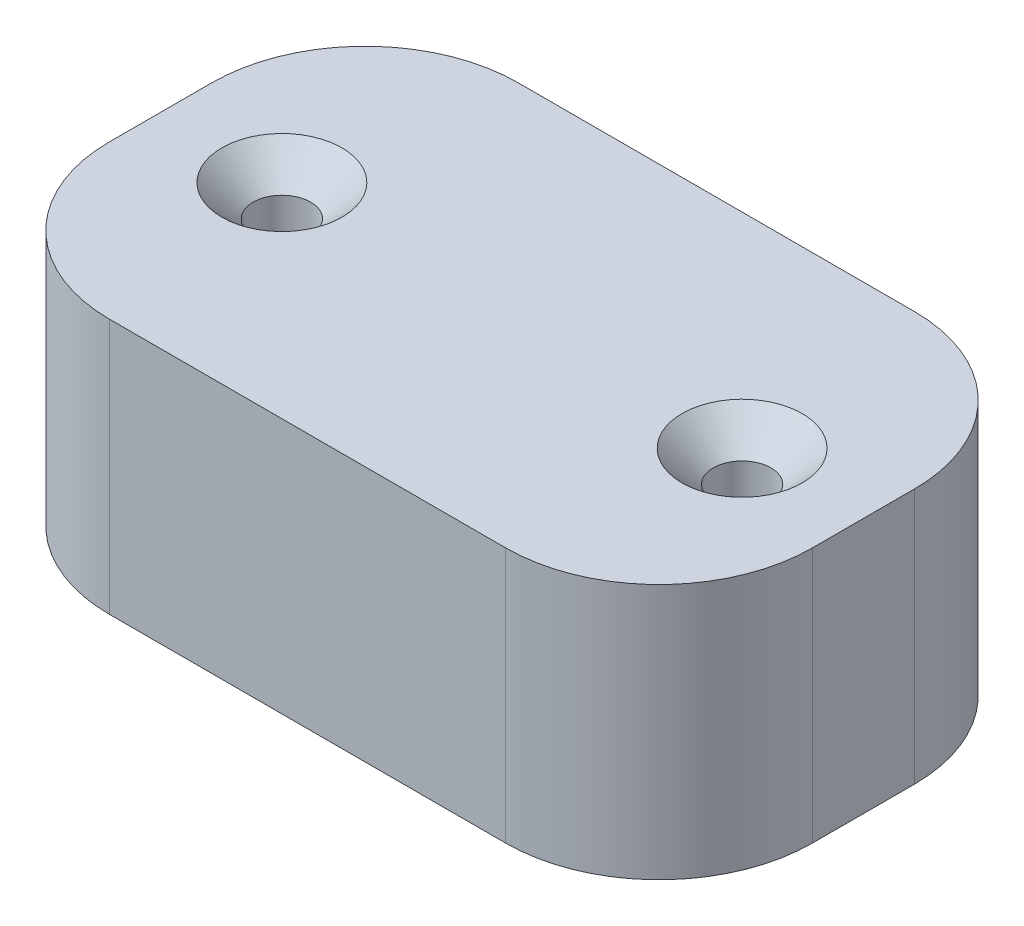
ISO-10303-21;
HEADER;
FILE_DESCRIPTION(('STEP AP214'),'2;1');
FILE_NAME('part.step','',(''),(''),'','','');
FILE_SCHEMA(('AUTOMOTIVE_DESIGN { 1 0 10303 214 1 1 1 1 }'));
ENDSEC;
DATA;
#1=APPLICATION_CONTEXT('core data for automotive mechanical design processes');
#2=APPLICATION_PROTOCOL_DEFINITION('international standard','automotive_design',2000,#1);
#3=PRODUCT_CONTEXT('',#1,'mechanical');
#4=PRODUCT('Part','Part','',(#3));
#5=PRODUCT_RELATED_PRODUCT_CATEGORY('part','',(#4));
#6=PRODUCT_DEFINITION_FORMATION('','',#4);
#7=PRODUCT_DEFINITION_CONTEXT('part definition',#1,'design');
#8=PRODUCT_DEFINITION('design','',#6,#7);
#9=PRODUCT_DEFINITION_SHAPE('','',#8);
#10=(LENGTH_UNIT() NAMED_UNIT(*) SI_UNIT(.MILLI.,.METRE.));
#11=(NAMED_UNIT(*) PLANE_ANGLE_UNIT() SI_UNIT($,.RADIAN.));
#12=(NAMED_UNIT(*) SI_UNIT($,.STERADIAN.) SOLID_ANGLE_UNIT());
#13=UNCERTAINTY_MEASURE_WITH_UNIT(LENGTH_MEASURE(1.E-05),#10,'distance_accuracy_value','');
#14=(GEOMETRIC_REPRESENTATION_CONTEXT(3) GLOBAL_UNCERTAINTY_ASSIGNED_CONTEXT((#13)) GLOBAL_UNIT_ASSIGNED_CONTEXT((#10,
#11,#12)) REPRESENTATION_CONTEXT('',''));
#15=CARTESIAN_POINT('',(0.,0.,0.));
#16=DIRECTION('',(0.,0.,1.));
#17=DIRECTION('',(1.,0.,0.));
#18=AXIS2_PLACEMENT_3D('',#15,#16,#17);
#19=CARTESIAN_POINT('',(-27.5,20.,16.));
#20=DIRECTION('',(0.,-1.,0.));
#21=DIRECTION('',(0.,0.,-1.));
#22=AXIS2_PLACEMENT_3D('',#19,#20,#21);
#23=PLANE('',#22);
#24=CARTESIAN_POINT('',(-18.,20.,0.));
#25=DIRECTION('',(0.,1.,0.));
#26=DIRECTION('',(0.,0.,1.));
#27=AXIS2_PLACEMENT_3D('',#24,#25,#26);
#28=CIRCLE('',#27,4.7);
#29=CARTESIAN_POINT('',(-18.,20.,4.7));
#30=VERTEX_POINT('',#29);
#31=EDGE_CURVE('E218',#30,#30,#28,.T.);
#32=ORIENTED_EDGE('',*,*,#31,.F.);
#33=EDGE_LOOP('',(#32));
#34=FACE_BOUND('',#33,.T.);
#35=DIRECTION('',(-1.,0.,0.));
#36=VECTOR('',#35,1.);
#37=CARTESIAN_POINT('',(-27.5,20.,16.));
#38=LINE('',#37,#36);
#39=CARTESIAN_POINT('',(15.5,20.,16.));
#40=VERTEX_POINT('',#39);
#41=CARTESIAN_POINT('',(-15.5,20.,16.));
#42=VERTEX_POINT('',#41);
#43=EDGE_CURVE('E113',#40,#42,#38,.T.);
#44=ORIENTED_EDGE('',*,*,#43,.F.);
#45=CARTESIAN_POINT('',(15.5,20.,4.));
#46=DIRECTION('',(0.,-1.,0.));
#47=DIRECTION('',(0.,0.,-1.));
#48=AXIS2_PLACEMENT_3D('',#45,#46,#47);
#49=CIRCLE('',#48,12.);
#50=CARTESIAN_POINT('',(27.5,20.,4.));
#51=VERTEX_POINT('',#50);
#52=EDGE_CURVE('E150',#40,#51,#49,.F.);
#53=ORIENTED_EDGE('',*,*,#52,.T.);
#54=DIRECTION('',(0.,0.,-1.));
#55=VECTOR('',#54,1.);
#56=CARTESIAN_POINT('',(27.5,20.,16.));
#57=LINE('',#56,#55);
#58=CARTESIAN_POINT('',(27.5,20.,-4.));
#59=VERTEX_POINT('',#58);
#60=EDGE_CURVE('E136',#51,#59,#57,.T.);
#61=ORIENTED_EDGE('',*,*,#60,.T.);
#62=CARTESIAN_POINT('',(15.5,20.,-4.));
#63=DIRECTION('',(0.,-1.,0.));
#64=DIRECTION('',(0.,0.,-1.));
#65=AXIS2_PLACEMENT_3D('',#62,#63,#64);
#66=CIRCLE('',#65,12.);
#67=CARTESIAN_POINT('',(15.5,20.,-16.));
#68=VERTEX_POINT('',#67);
#69=EDGE_CURVE('E148',#59,#68,#66,.F.);
#70=ORIENTED_EDGE('',*,*,#69,.T.);
#71=DIRECTION('',(-1.,0.,0.));
#72=VECTOR('',#71,1.);
#73=CARTESIAN_POINT('',(-27.5,20.,-16.));
#74=LINE('',#73,#72);
#75=CARTESIAN_POINT('',(-15.5,20.,-16.));
#76=VERTEX_POINT('',#75);
#77=EDGE_CURVE('E121',#68,#76,#74,.T.);
#78=ORIENTED_EDGE('',*,*,#77,.T.);
#79=CARTESIAN_POINT('',(-15.5,20.,-4.));
#80=DIRECTION('',(0.,-1.,0.));
#81=DIRECTION('',(0.,0.,-1.));
#82=AXIS2_PLACEMENT_3D('',#79,#80,#81);
#83=CIRCLE('',#82,12.);
#84=CARTESIAN_POINT('',(-27.5,20.,-4.));
#85=VERTEX_POINT('',#84);
#86=EDGE_CURVE('E146',#76,#85,#83,.F.);
#87=ORIENTED_EDGE('',*,*,#86,.T.);
#88=DIRECTION('',(0.,0.,-1.));
#89=VECTOR('',#88,1.);
#90=CARTESIAN_POINT('',(-27.5,20.,16.));
#91=LINE('',#90,#89);
#92=CARTESIAN_POINT('',(-27.5,20.,4.));
#93=VERTEX_POINT('',#92);
#94=EDGE_CURVE('E123',#93,#85,#91,.T.);
#95=ORIENTED_EDGE('',*,*,#94,.F.);
#96=CARTESIAN_POINT('',(-15.5,20.,4.));
#97=DIRECTION('',(0.,-1.,0.));
#98=DIRECTION('',(0.,0.,-1.));
#99=AXIS2_PLACEMENT_3D('',#96,#97,#98);
#100=CIRCLE('',#99,12.);
#101=EDGE_CURVE('E144',#93,#42,#100,.F.);
#102=ORIENTED_EDGE('',*,*,#101,.T.);
#103=EDGE_LOOP('',(#44,#53,#61,#70,#78,#87,#95,#102));
#104=FACE_BOUND('',#103,.T.);
#105=CARTESIAN_POINT('',(18.,20.,0.));
#106=DIRECTION('',(0.,1.,0.));
#107=DIRECTION('',(0.,0.,1.));
#108=AXIS2_PLACEMENT_3D('',#105,#106,#107);
#109=CIRCLE('',#108,4.7);
#110=CARTESIAN_POINT('',(18.,20.,4.7));
#111=VERTEX_POINT('',#110);
#112=EDGE_CURVE('E228',#111,#111,#109,.T.);
#113=ORIENTED_EDGE('',*,*,#112,.F.);
#114=EDGE_LOOP('',(#113));
#115=FACE_BOUND('',#114,.T.);
#116=ADVANCED_FACE('F34',(#34,#104,#115),#23,.F.);
#117=CARTESIAN_POINT('',(-27.5,0.,16.));
#118=DIRECTION('',(1.,0.,0.));
#119=DIRECTION('',(0.,0.,-1.));
#120=AXIS2_PLACEMENT_3D('',#117,#118,#119);
#121=PLANE('',#120);
#122=ORIENTED_EDGE('',*,*,#94,.T.);
#123=DIRECTION('',(0.,-1.,0.));
#124=VECTOR('',#123,1.);
#125=CARTESIAN_POINT('',(-27.5,0.,-4.));
#126=LINE('',#125,#124);
#127=CARTESIAN_POINT('',(-27.5,0.,-4.));
#128=VERTEX_POINT('',#127);
#129=EDGE_CURVE('E11',#85,#128,#126,.T.);
#130=ORIENTED_EDGE('',*,*,#129,.T.);
#131=DIRECTION('',(0.,0.,-1.));
#132=VECTOR('',#131,1.);
#133=CARTESIAN_POINT('',(-27.5,0.,16.));
#134=LINE('',#133,#132);
#135=CARTESIAN_POINT('',(-27.5,0.,4.));
#136=VERTEX_POINT('',#135);
#137=EDGE_CURVE('E115',#136,#128,#134,.T.);
#138=ORIENTED_EDGE('',*,*,#137,.F.);
#139=DIRECTION('',(0.,-1.,0.));
#140=VECTOR('',#139,1.);
#141=CARTESIAN_POINT('',(-27.5,0.,4.));
#142=LINE('',#141,#140);
#143=EDGE_CURVE('E42',#136,#93,#142,.F.);
#144=ORIENTED_EDGE('',*,*,#143,.T.);
#145=EDGE_LOOP('',(#122,#130,#138,#144));
#146=FACE_BOUND('',#145,.T.);
#147=ADVANCED_FACE('F165',(#146),#121,.F.);
#148=CARTESIAN_POINT('',(-27.5,0.,16.));
#149=DIRECTION('',(0.,1.,0.));
#150=DIRECTION('',(0.,0.,1.));
#151=AXIS2_PLACEMENT_3D('',#148,#149,#150);
#152=PLANE('',#151);
#153=CARTESIAN_POINT('',(18.,0.,0.));
#154=DIRECTION('',(0.,1.,0.));
#155=DIRECTION('',(0.,0.,1.));
#156=AXIS2_PLACEMENT_3D('',#153,#154,#155);
#157=CIRCLE('',#156,2.25);
#158=CARTESIAN_POINT('',(18.,0.,2.25));
#159=VERTEX_POINT('',#158);
#160=EDGE_CURVE('E212',#159,#159,#157,.T.);
#161=ORIENTED_EDGE('',*,*,#160,.T.);
#162=EDGE_LOOP('',(#161));
#163=FACE_BOUND('',#162,.T.);
#164=CARTESIAN_POINT('',(-18.,0.,0.));
#165=DIRECTION('',(0.,1.,0.));
#166=DIRECTION('',(0.,0.,1.));
#167=AXIS2_PLACEMENT_3D('',#164,#165,#166);
#168=CIRCLE('',#167,2.25);
#169=CARTESIAN_POINT('',(-18.,0.,2.25));
#170=VERTEX_POINT('',#169);
#171=EDGE_CURVE('E129',#170,#170,#168,.T.);
#172=ORIENTED_EDGE('',*,*,#171,.T.);
#173=EDGE_LOOP('',(#172));
#174=FACE_BOUND('',#173,.T.);
#175=DIRECTION('',(0.,0.,-1.));
#176=VECTOR('',#175,1.);
#177=CARTESIAN_POINT('',(27.5,0.,16.));
#178=LINE('',#177,#176);
#179=CARTESIAN_POINT('',(27.5,0.,4.));
#180=VERTEX_POINT('',#179);
#181=CARTESIAN_POINT('',(27.5,0.,-4.));
#182=VERTEX_POINT('',#181);
#183=EDGE_CURVE('E139',#180,#182,#178,.T.);
#184=ORIENTED_EDGE('',*,*,#183,.F.);
#185=CARTESIAN_POINT('',(15.5,0.,4.));
#186=DIRECTION('',(0.,1.,0.));
#187=DIRECTION('',(0.,0.,1.));
#188=AXIS2_PLACEMENT_3D('',#185,#186,#187);
#189=CIRCLE('',#188,12.);
#190=CARTESIAN_POINT('',(15.5,0.,16.));
#191=VERTEX_POINT('',#190);
#192=EDGE_CURVE('E120',#180,#191,#189,.F.);
#193=ORIENTED_EDGE('',*,*,#192,.T.);
#194=DIRECTION('',(1.,0.,0.));
#195=VECTOR('',#194,1.);
#196=CARTESIAN_POINT('',(-27.5,0.,16.));
#197=LINE('',#196,#195);
#198=CARTESIAN_POINT('',(-15.5,0.,16.));
#199=VERTEX_POINT('',#198);
#200=EDGE_CURVE('E110',#199,#191,#197,.T.);
#201=ORIENTED_EDGE('',*,*,#200,.F.);
#202=CARTESIAN_POINT('',(-15.5,0.,4.));
#203=DIRECTION('',(0.,1.,0.));
#204=DIRECTION('',(0.,0.,1.));
#205=AXIS2_PLACEMENT_3D('',#202,#203,#204);
#206=CIRCLE('',#205,12.);
#207=EDGE_CURVE('E56',#199,#136,#206,.F.);
#208=ORIENTED_EDGE('',*,*,#207,.T.);
#209=ORIENTED_EDGE('',*,*,#137,.T.);
#210=CARTESIAN_POINT('',(-15.5,0.,-4.));
#211=DIRECTION('',(0.,1.,0.));
#212=DIRECTION('',(0.,0.,1.));
#213=AXIS2_PLACEMENT_3D('',#210,#211,#212);
#214=CIRCLE('',#213,12.);
#215=CARTESIAN_POINT('',(-15.5,0.,-16.));
#216=VERTEX_POINT('',#215);
#217=EDGE_CURVE('E49',#128,#216,#214,.F.);
#218=ORIENTED_EDGE('',*,*,#217,.T.);
#219=DIRECTION('',(1.,0.,0.));
#220=VECTOR('',#219,1.);
#221=CARTESIAN_POINT('',(-27.5,0.,-16.));
#222=LINE('',#221,#220);
#223=CARTESIAN_POINT('',(15.5,0.,-16.));
#224=VERTEX_POINT('',#223);
#225=EDGE_CURVE('E126',#216,#224,#222,.T.);
#226=ORIENTED_EDGE('',*,*,#225,.T.);
#227=CARTESIAN_POINT('',(15.5,0.,-4.));
#228=DIRECTION('',(0.,1.,0.));
#229=DIRECTION('',(0.,0.,1.));
#230=AXIS2_PLACEMENT_3D('',#227,#228,#229);
#231=CIRCLE('',#230,12.);
#232=EDGE_CURVE('E157',#224,#182,#231,.F.);
#233=ORIENTED_EDGE('',*,*,#232,.T.);
#234=EDGE_LOOP('',(#184,#193,#201,#208,#209,#218,#226,#233));
#235=FACE_BOUND('',#234,.T.);
#236=ADVANCED_FACE('F118',(#163,#174,#235),#152,.F.);
#237=CARTESIAN_POINT('',(27.5,0.,16.));
#238=DIRECTION('',(-1.,0.,0.));
#239=DIRECTION('',(0.,0.,1.));
#240=AXIS2_PLACEMENT_3D('',#237,#238,#239);
#241=PLANE('',#240);
#242=ORIENTED_EDGE('',*,*,#60,.F.);
#243=DIRECTION('',(0.,1.,0.));
#244=VECTOR('',#243,1.);
#245=CARTESIAN_POINT('',(27.5,0.,4.));
#246=LINE('',#245,#244);
#247=EDGE_CURVE('E103',#51,#180,#246,.F.);
#248=ORIENTED_EDGE('',*,*,#247,.T.);
#249=ORIENTED_EDGE('',*,*,#183,.T.);
#250=DIRECTION('',(0.,1.,0.));
#251=VECTOR('',#250,1.);
#252=CARTESIAN_POINT('',(27.5,20.,-4.));
#253=LINE('',#252,#251);
#254=EDGE_CURVE('E152',#182,#59,#253,.T.);
#255=ORIENTED_EDGE('',*,*,#254,.T.);
#256=EDGE_LOOP('',(#242,#248,#249,#255));
#257=FACE_BOUND('',#256,.T.);
#258=ADVANCED_FACE('F181',(#257),#241,.F.);
#259=CARTESIAN_POINT('',(-27.5,20.,16.));
#260=DIRECTION('',(0.,0.,-1.));
#261=DIRECTION('',(-1.,0.,0.));
#262=AXIS2_PLACEMENT_3D('',#259,#260,#261);
#263=PLANE('',#262);
#264=ORIENTED_EDGE('',*,*,#200,.T.);
#265=DIRECTION('',(0.,1.,0.));
#266=VECTOR('',#265,1.);
#267=CARTESIAN_POINT('',(15.5,20.,16.));
#268=LINE('',#267,#266);
#269=EDGE_CURVE('E114',#191,#40,#268,.T.);
#270=ORIENTED_EDGE('',*,*,#269,.T.);
#271=ORIENTED_EDGE('',*,*,#43,.T.);
#272=DIRECTION('',(0.,-1.,0.));
#273=VECTOR('',#272,1.);
#274=CARTESIAN_POINT('',(-15.5,20.,16.));
#275=LINE('',#274,#273);
#276=EDGE_CURVE('E102',#42,#199,#275,.T.);
#277=ORIENTED_EDGE('',*,*,#276,.T.);
#278=EDGE_LOOP('',(#264,#270,#271,#277));
#279=FACE_BOUND('',#278,.T.);
#280=ADVANCED_FACE('F108',(#279),#263,.F.);
#281=CARTESIAN_POINT('',(-27.5,20.,-16.));
#282=DIRECTION('',(0.,0.,-1.));
#283=DIRECTION('',(-1.,0.,0.));
#284=AXIS2_PLACEMENT_3D('',#281,#282,#283);
#285=PLANE('',#284);
#286=ORIENTED_EDGE('',*,*,#77,.F.);
#287=DIRECTION('',(0.,1.,0.));
#288=VECTOR('',#287,1.);
#289=CARTESIAN_POINT('',(15.5,0.,-16.));
#290=LINE('',#289,#288);
#291=EDGE_CURVE('E162',#68,#224,#290,.F.);
#292=ORIENTED_EDGE('',*,*,#291,.T.);
#293=ORIENTED_EDGE('',*,*,#225,.F.);
#294=DIRECTION('',(0.,-1.,0.));
#295=VECTOR('',#294,1.);
#296=CARTESIAN_POINT('',(-15.5,20.,-16.));
#297=LINE('',#296,#295);
#298=EDGE_CURVE('E160',#216,#76,#297,.F.);
#299=ORIENTED_EDGE('',*,*,#298,.T.);
#300=EDGE_LOOP('',(#286,#292,#293,#299));
#301=FACE_BOUND('',#300,.T.);
#302=ADVANCED_FACE('F174',(#301),#285,.T.);
#303=CARTESIAN_POINT('',(15.5,20.,4.));
#304=DIRECTION('',(0.,1.,0.));
#305=DIRECTION('',(0.,0.,1.));
#306=AXIS2_PLACEMENT_3D('',#303,#304,#305);
#307=CYLINDRICAL_SURFACE('',#306,12.);
#308=ORIENTED_EDGE('',*,*,#192,.F.);
#309=ORIENTED_EDGE('',*,*,#247,.F.);
#310=ORIENTED_EDGE('',*,*,#52,.F.);
#311=ORIENTED_EDGE('',*,*,#269,.F.);
#312=EDGE_LOOP('',(#308,#309,#310,#311));
#313=FACE_BOUND('',#312,.T.);
#314=ADVANCED_FACE('F184',(#313),#307,.T.);
#315=CARTESIAN_POINT('',(15.5,0.,-4.));
#316=DIRECTION('',(0.,-1.,0.));
#317=DIRECTION('',(0.,0.,-1.));
#318=AXIS2_PLACEMENT_3D('',#315,#316,#317);
#319=CYLINDRICAL_SURFACE('',#318,12.);
#320=ORIENTED_EDGE('',*,*,#232,.F.);
#321=ORIENTED_EDGE('',*,*,#291,.F.);
#322=ORIENTED_EDGE('',*,*,#69,.F.);
#323=ORIENTED_EDGE('',*,*,#254,.F.);
#324=EDGE_LOOP('',(#320,#321,#322,#323));
#325=FACE_BOUND('',#324,.T.);
#326=ADVANCED_FACE('F177',(#325),#319,.T.);
#327=CARTESIAN_POINT('',(-15.5,0.,-4.));
#328=DIRECTION('',(0.,1.,0.));
#329=DIRECTION('',(0.,0.,1.));
#330=AXIS2_PLACEMENT_3D('',#327,#328,#329);
#331=CYLINDRICAL_SURFACE('',#330,12.);
#332=ORIENTED_EDGE('',*,*,#86,.F.);
#333=ORIENTED_EDGE('',*,*,#298,.F.);
#334=ORIENTED_EDGE('',*,*,#217,.F.);
#335=ORIENTED_EDGE('',*,*,#129,.F.);
#336=EDGE_LOOP('',(#332,#333,#334,#335));
#337=FACE_BOUND('',#336,.T.);
#338=ADVANCED_FACE('F170',(#337),#331,.T.);
#339=CARTESIAN_POINT('',(-15.5,20.,4.));
#340=DIRECTION('',(0.,-1.,0.));
#341=DIRECTION('',(0.,0.,-1.));
#342=AXIS2_PLACEMENT_3D('',#339,#340,#341);
#343=CYLINDRICAL_SURFACE('',#342,12.);
#344=ORIENTED_EDGE('',*,*,#101,.F.);
#345=ORIENTED_EDGE('',*,*,#143,.F.);
#346=ORIENTED_EDGE('',*,*,#207,.F.);
#347=ORIENTED_EDGE('',*,*,#276,.F.);
#348=EDGE_LOOP('',(#344,#345,#346,#347));
#349=FACE_BOUND('',#348,.T.);
#350=ADVANCED_FACE('F36',(#349),#343,.T.);
#351=CARTESIAN_POINT('',(-18.,20.,0.));
#352=DIRECTION('',(0.,1.,0.));
#353=DIRECTION('',(0.,0.,1.));
#354=AXIS2_PLACEMENT_3D('',#351,#352,#353);
#355=CYLINDRICAL_SURFACE('',#354,2.24999999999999);
#356=ORIENTED_EDGE('',*,*,#171,.F.);
#357=EDGE_LOOP('',(#356));
#358=FACE_BOUND('',#357,.T.);
#359=CARTESIAN_POINT('',(-18.,17.55,0.));
#360=DIRECTION('',(0.,1.,0.));
#361=DIRECTION('',(0.,0.,1.));
#362=AXIS2_PLACEMENT_3D('',#359,#360,#361);
#363=CIRCLE('',#362,2.24999999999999);
#364=CARTESIAN_POINT('',(-18.,17.55,2.24999999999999));
#365=VERTEX_POINT('',#364);
#366=EDGE_CURVE('E216',#365,#365,#363,.T.);
#367=ORIENTED_EDGE('',*,*,#366,.T.);
#368=EDGE_LOOP('',(#367));
#369=FACE_BOUND('',#368,.T.);
#370=ADVANCED_FACE('F247',(#358,#369),#355,.F.);
#371=CARTESIAN_POINT('',(-18.,20.,0.));
#372=DIRECTION('',(0.,1.,0.));
#373=DIRECTION('',(0.,0.,1.));
#374=AXIS2_PLACEMENT_3D('',#371,#372,#373);
#375=CONICAL_SURFACE('',#374,4.7,0.785398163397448);
#376=ORIENTED_EDGE('',*,*,#366,.F.);
#377=EDGE_LOOP('',(#376));
#378=FACE_BOUND('',#377,.T.);
#379=ORIENTED_EDGE('',*,*,#31,.T.);
#380=EDGE_LOOP('',(#379));
#381=FACE_BOUND('',#380,.T.);
#382=ADVANCED_FACE('F240',(#378,#381),#375,.F.);
#383=CARTESIAN_POINT('',(18.,20.,0.));
#384=DIRECTION('',(0.,1.,0.));
#385=DIRECTION('',(0.,0.,1.));
#386=AXIS2_PLACEMENT_3D('',#383,#384,#385);
#387=CYLINDRICAL_SURFACE('',#386,2.24999999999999);
#388=ORIENTED_EDGE('',*,*,#160,.F.);
#389=EDGE_LOOP('',(#388));
#390=FACE_BOUND('',#389,.T.);
#391=CARTESIAN_POINT('',(18.,17.55,0.));
#392=DIRECTION('',(0.,1.,0.));
#393=DIRECTION('',(0.,0.,1.));
#394=AXIS2_PLACEMENT_3D('',#391,#392,#393);
#395=CIRCLE('',#394,2.24999999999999);
#396=CARTESIAN_POINT('',(18.,17.55,2.24999999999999));
#397=VERTEX_POINT('',#396);
#398=EDGE_CURVE('E225',#397,#397,#395,.T.);
#399=ORIENTED_EDGE('',*,*,#398,.T.);
#400=EDGE_LOOP('',(#399));
#401=FACE_BOUND('',#400,.T.);
#402=ADVANCED_FACE('F234',(#390,#401),#387,.F.);
#403=CARTESIAN_POINT('',(18.,20.,0.));
#404=DIRECTION('',(0.,1.,0.));
#405=DIRECTION('',(0.,0.,1.));
#406=AXIS2_PLACEMENT_3D('',#403,#404,#405);
#407=CONICAL_SURFACE('',#406,4.7,0.785398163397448);
#408=ORIENTED_EDGE('',*,*,#398,.F.);
#409=EDGE_LOOP('',(#408));
#410=FACE_BOUND('',#409,.T.);
#411=ORIENTED_EDGE('',*,*,#112,.T.);
#412=EDGE_LOOP('',(#411));
#413=FACE_BOUND('',#412,.T.);
#414=ADVANCED_FACE('F232',(#410,#413),#407,.F.);
#415=CLOSED_SHELL('',(#116,#147,#236,#258,#280,#302,#314,#326,#338,#350,#370,#382,#402,#414));
#416=MANIFOLD_SOLID_BREP('B2',#415);
#417=ADVANCED_BREP_SHAPE_REPRESENTATION('',(#18,#416),#14);
#418=SHAPE_DEFINITION_REPRESENTATION(#9,#417);
ENDSEC;
END-ISO-10303-21;
